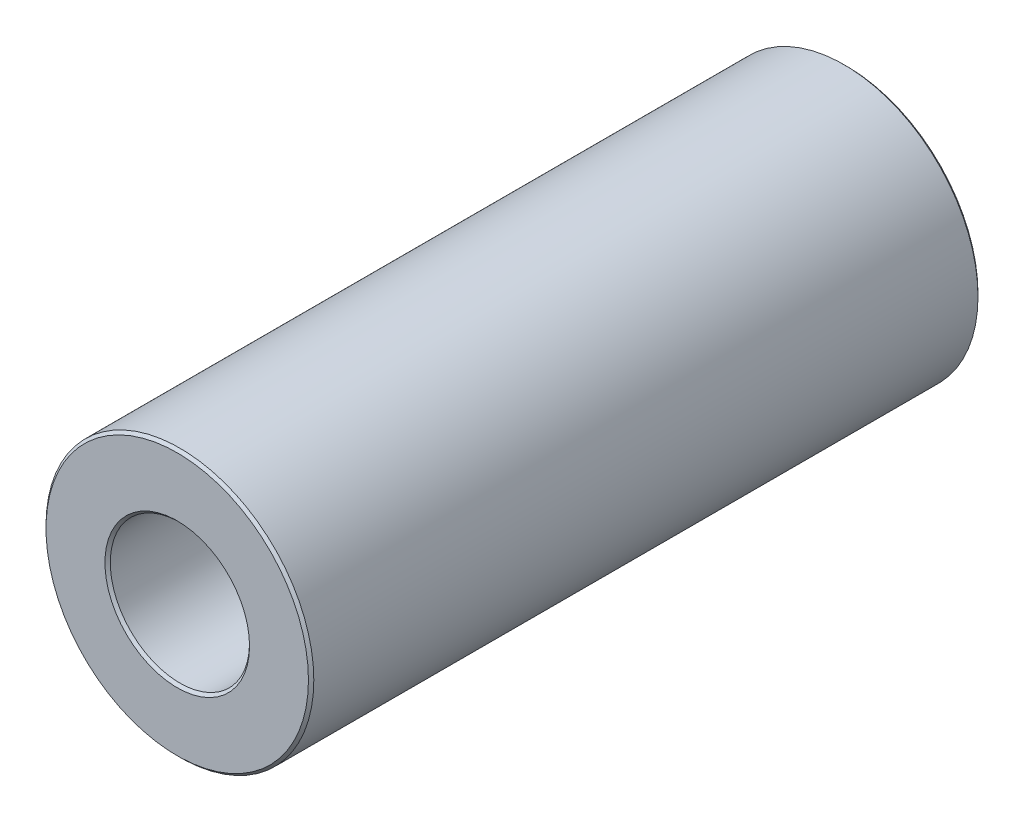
from build123d import *

# Parameters (mm, degrees)
SKETCH1_R           = 5
SKETCH1_R_2         = 2.6
BOSS_EXTRUDE2_DEPTH = 12.5
CHAMFER3_SIZE       = 0.1


with BuildPart() as part:
    # Sketch1 → Boss-Extrude2 (new, symmetric)
    with BuildSketch(Plane.XY):
        Circle(SKETCH1_R)
        Circle(SKETCH1_R_2, mode=Mode.SUBTRACT)
    extrude(amount=BOSS_EXTRUDE2_DEPTH, both=True)

    # Chamfer3
    chamfer3_edges = [part.edges().sort_by_distance(p)[0] for p in [
        (-5, 0, -12.5),
        (-5, 0, 12.5),
        (-2.6, 0, -12.5),
        (-2.6, 0, 12.5),
    ]]
    chamfer(chamfer3_edges, length=CHAMFER3_SIZE)


solid = part.part
